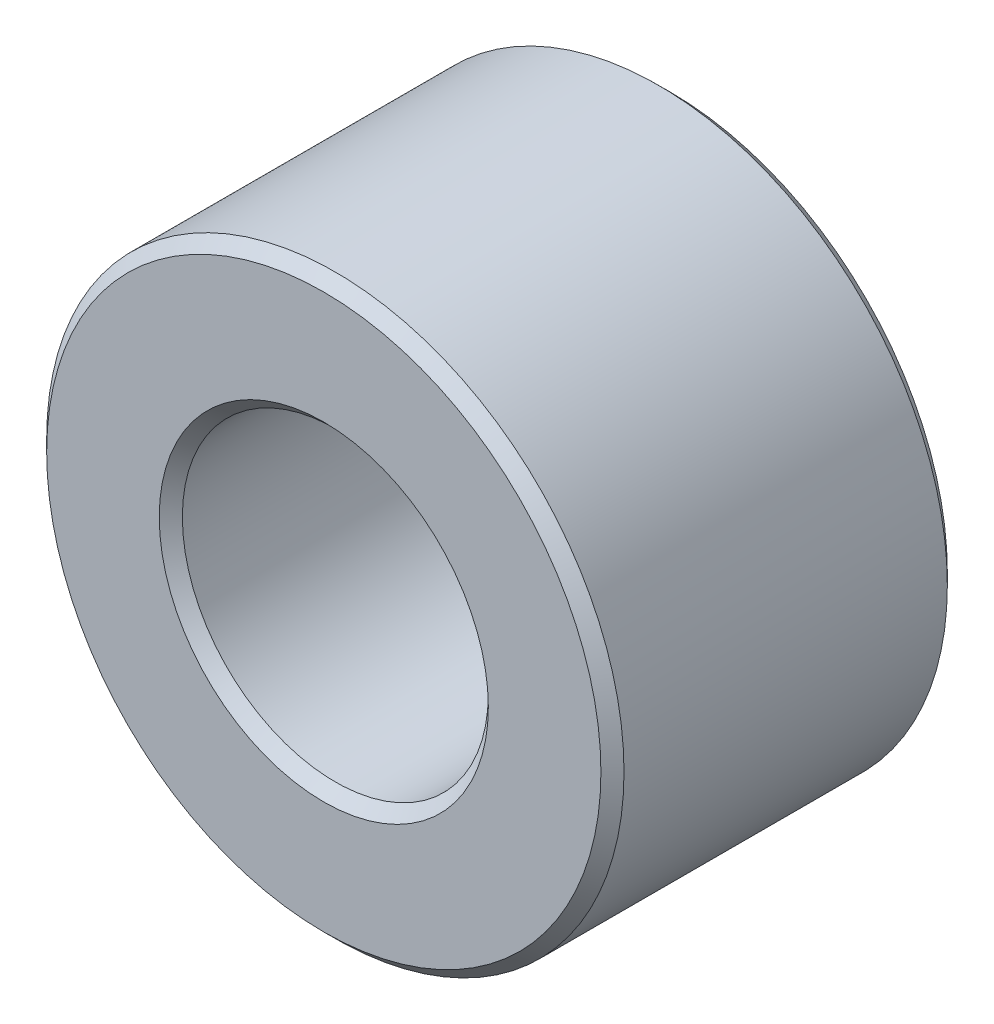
ISO-10303-21;
HEADER;
FILE_DESCRIPTION(('STEP AP214'),'2;1');
FILE_NAME('part.step','',(''),(''),'','','');
FILE_SCHEMA(('AUTOMOTIVE_DESIGN { 1 0 10303 214 1 1 1 1 }'));
ENDSEC;
DATA;
#1=APPLICATION_CONTEXT('core data for automotive mechanical design processes');
#2=APPLICATION_PROTOCOL_DEFINITION('international standard','automotive_design',2000,#1);
#3=PRODUCT_CONTEXT('',#1,'mechanical');
#4=PRODUCT('Part','Part','',(#3));
#5=PRODUCT_RELATED_PRODUCT_CATEGORY('part','',(#4));
#6=PRODUCT_DEFINITION_FORMATION('','',#4);
#7=PRODUCT_DEFINITION_CONTEXT('part definition',#1,'design');
#8=PRODUCT_DEFINITION('design','',#6,#7);
#9=PRODUCT_DEFINITION_SHAPE('','',#8);
#10=(LENGTH_UNIT() NAMED_UNIT(*) SI_UNIT(.MILLI.,.METRE.));
#11=(NAMED_UNIT(*) PLANE_ANGLE_UNIT() SI_UNIT($,.RADIAN.));
#12=(NAMED_UNIT(*) SI_UNIT($,.STERADIAN.) SOLID_ANGLE_UNIT());
#13=UNCERTAINTY_MEASURE_WITH_UNIT(LENGTH_MEASURE(1.E-05),#10,'distance_accuracy_value','');
#14=(GEOMETRIC_REPRESENTATION_CONTEXT(3) GLOBAL_UNCERTAINTY_ASSIGNED_CONTEXT((#13)) GLOBAL_UNIT_ASSIGNED_CONTEXT((#10,
#11,#12)) REPRESENTATION_CONTEXT('',''));
#15=CARTESIAN_POINT('',(0.,0.,0.));
#16=DIRECTION('',(0.,0.,1.));
#17=DIRECTION('',(1.,0.,0.));
#18=AXIS2_PLACEMENT_3D('',#15,#16,#17);
#19=CARTESIAN_POINT('',(0.,0.,3.));
#20=DIRECTION('',(0.,0.,1.));
#21=DIRECTION('',(1.,0.,0.));
#22=AXIS2_PLACEMENT_3D('',#19,#20,#21);
#23=PLANE('',#22);
#24=CARTESIAN_POINT('',(0.,0.,3.));
#25=DIRECTION('',(0.,0.,1.));
#26=DIRECTION('',(1.,0.,0.));
#27=AXIS2_PLACEMENT_3D('',#24,#25,#26);
#28=CIRCLE('',#27,2.85);
#29=CARTESIAN_POINT('',(2.85,0.,3.));
#30=VERTEX_POINT('',#29);
#31=EDGE_CURVE('E10',#30,#30,#28,.F.);
#32=ORIENTED_EDGE('',*,*,#31,.T.);
#33=EDGE_LOOP('',(#32));
#34=FACE_BOUND('',#33,.T.);
#35=CARTESIAN_POINT('',(0.,0.,3.));
#36=DIRECTION('',(0.,0.,1.));
#37=DIRECTION('',(1.,0.,0.));
#38=AXIS2_PLACEMENT_3D('',#35,#36,#37);
#39=CIRCLE('',#38,4.8);
#40=CARTESIAN_POINT('',(4.8,0.,3.));
#41=VERTEX_POINT('',#40);
#42=EDGE_CURVE('E45',#41,#41,#39,.T.);
#43=ORIENTED_EDGE('',*,*,#42,.T.);
#44=EDGE_LOOP('',(#43));
#45=FACE_BOUND('',#44,.T.);
#46=ADVANCED_FACE('F37',(#34,#45),#23,.T.);
#47=CARTESIAN_POINT('',(0.,0.,-3.));
#48=DIRECTION('',(0.,0.,1.));
#49=DIRECTION('',(1.,0.,0.));
#50=AXIS2_PLACEMENT_3D('',#47,#48,#49);
#51=PLANE('',#50);
#52=CARTESIAN_POINT('',(0.,0.,-3.));
#53=DIRECTION('',(0.,0.,1.));
#54=DIRECTION('',(1.,0.,0.));
#55=AXIS2_PLACEMENT_3D('',#52,#53,#54);
#56=CIRCLE('',#55,4.8);
#57=CARTESIAN_POINT('',(4.8,0.,-3.));
#58=VERTEX_POINT('',#57);
#59=EDGE_CURVE('E64',#58,#58,#56,.F.);
#60=ORIENTED_EDGE('',*,*,#59,.T.);
#61=EDGE_LOOP('',(#60));
#62=FACE_BOUND('',#61,.T.);
#63=CARTESIAN_POINT('',(0.,0.,-3.));
#64=DIRECTION('',(0.,0.,1.));
#65=DIRECTION('',(1.,0.,0.));
#66=AXIS2_PLACEMENT_3D('',#63,#64,#65);
#67=CIRCLE('',#66,2.85);
#68=CARTESIAN_POINT('',(-2.85,0.,-3.));
#69=VERTEX_POINT('',#68);
#70=EDGE_CURVE('E67',#69,#69,#67,.T.);
#71=ORIENTED_EDGE('',*,*,#70,.T.);
#72=EDGE_LOOP('',(#71));
#73=FACE_BOUND('',#72,.T.);
#74=ADVANCED_FACE('F89',(#62,#73),#51,.F.);
#75=CARTESIAN_POINT('',(0.,0.,3.));
#76=DIRECTION('',(0.,0.,-1.));
#77=DIRECTION('',(-1.,0.,0.));
#78=AXIS2_PLACEMENT_3D('',#75,#76,#77);
#79=CYLINDRICAL_SURFACE('',#78,5.);
#80=CARTESIAN_POINT('',(0.,0.,-2.8));
#81=DIRECTION('',(0.,0.,1.));
#82=DIRECTION('',(1.,0.,0.));
#83=AXIS2_PLACEMENT_3D('',#80,#81,#82);
#84=CIRCLE('',#83,5.);
#85=CARTESIAN_POINT('',(5.,0.,-2.8));
#86=VERTEX_POINT('',#85);
#87=EDGE_CURVE('E71',#86,#86,#84,.T.);
#88=ORIENTED_EDGE('',*,*,#87,.T.);
#89=EDGE_LOOP('',(#88));
#90=FACE_BOUND('',#89,.T.);
#91=CARTESIAN_POINT('',(0.,0.,2.8));
#92=DIRECTION('',(0.,0.,1.));
#93=DIRECTION('',(1.,0.,0.));
#94=AXIS2_PLACEMENT_3D('',#91,#92,#93);
#95=CIRCLE('',#94,5.);
#96=CARTESIAN_POINT('',(5.,0.,2.8));
#97=VERTEX_POINT('',#96);
#98=EDGE_CURVE('E74',#97,#97,#95,.F.);
#99=ORIENTED_EDGE('',*,*,#98,.T.);
#100=EDGE_LOOP('',(#99));
#101=FACE_BOUND('',#100,.T.);
#102=ADVANCED_FACE('F78',(#90,#101),#79,.T.);
#103=CARTESIAN_POINT('',(0.,0.,3.));
#104=DIRECTION('',(0.,0.,-1.));
#105=DIRECTION('',(-1.,0.,0.));
#106=AXIS2_PLACEMENT_3D('',#103,#104,#105);
#107=CYLINDRICAL_SURFACE('',#106,2.65);
#108=CARTESIAN_POINT('',(0.,0.,-2.8));
#109=DIRECTION('',(0.,0.,1.));
#110=DIRECTION('',(1.,0.,0.));
#111=AXIS2_PLACEMENT_3D('',#108,#109,#110);
#112=CIRCLE('',#111,2.65);
#113=CARTESIAN_POINT('',(-2.65,0.,-2.8));
#114=VERTEX_POINT('',#113);
#115=EDGE_CURVE('E52',#114,#114,#112,.F.);
#116=ORIENTED_EDGE('',*,*,#115,.T.);
#117=EDGE_LOOP('',(#116));
#118=FACE_BOUND('',#117,.T.);
#119=CARTESIAN_POINT('',(0.,0.,2.8));
#120=DIRECTION('',(0.,0.,1.));
#121=DIRECTION('',(1.,0.,0.));
#122=AXIS2_PLACEMENT_3D('',#119,#120,#121);
#123=CIRCLE('',#122,2.65);
#124=CARTESIAN_POINT('',(2.65,0.,2.8));
#125=VERTEX_POINT('',#124);
#126=EDGE_CURVE('E58',#125,#125,#123,.T.);
#127=ORIENTED_EDGE('',*,*,#126,.T.);
#128=EDGE_LOOP('',(#127));
#129=FACE_BOUND('',#128,.T.);
#130=ADVANCED_FACE('F97',(#118,#129),#107,.F.);
#131=CARTESIAN_POINT('',(0.,0.,-2.8));
#132=DIRECTION('',(0.,0.,1.));
#133=DIRECTION('',(1.,0.,0.));
#134=AXIS2_PLACEMENT_3D('',#131,#132,#133);
#135=CONICAL_SURFACE('',#134,5.,0.785398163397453);
#136=ORIENTED_EDGE('',*,*,#59,.F.);
#137=EDGE_LOOP('',(#136));
#138=FACE_BOUND('',#137,.T.);
#139=ORIENTED_EDGE('',*,*,#87,.F.);
#140=EDGE_LOOP('',(#139));
#141=FACE_BOUND('',#140,.T.);
#142=ADVANCED_FACE('F102',(#138,#141),#135,.T.);
#143=CARTESIAN_POINT('',(0.,0.,-3.));
#144=DIRECTION('',(0.,0.,-1.));
#145=DIRECTION('',(-1.,0.,0.));
#146=AXIS2_PLACEMENT_3D('',#143,#144,#145);
#147=CONICAL_SURFACE('',#146,2.85,0.785398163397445);
#148=CARTESIAN_POINT('',(-2.65,0.,-2.8));
#149=CARTESIAN_POINT('',(-2.65208333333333,0.,-2.80208333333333));
#150=CARTESIAN_POINT('',(-2.65416666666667,0.,-2.80416666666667));
#151=CARTESIAN_POINT('',(-2.65833333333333,0.,-2.80833333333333));
#152=CARTESIAN_POINT('',(-2.66041666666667,0.,-2.81041666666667));
#153=CARTESIAN_POINT('',(-2.66458333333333,0.,-2.81458333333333));
#154=CARTESIAN_POINT('',(-2.66666666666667,0.,-2.81666666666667));
#155=CARTESIAN_POINT('',(-2.67083333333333,0.,-2.82083333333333));
#156=CARTESIAN_POINT('',(-2.67291666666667,0.,-2.82291666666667));
#157=CARTESIAN_POINT('',(-2.67708333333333,0.,-2.82708333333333));
#158=CARTESIAN_POINT('',(-2.67916666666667,0.,-2.82916666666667));
#159=CARTESIAN_POINT('',(-2.68333333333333,0.,-2.83333333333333));
#160=CARTESIAN_POINT('',(-2.68541666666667,0.,-2.83541666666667));
#161=CARTESIAN_POINT('',(-2.68958333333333,0.,-2.83958333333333));
#162=CARTESIAN_POINT('',(-2.69166666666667,0.,-2.84166666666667));
#163=CARTESIAN_POINT('',(-2.69583333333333,0.,-2.84583333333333));
#164=CARTESIAN_POINT('',(-2.69791666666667,0.,-2.84791666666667));
#165=CARTESIAN_POINT('',(-2.70208333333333,0.,-2.85208333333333));
#166=CARTESIAN_POINT('',(-2.70416666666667,0.,-2.85416666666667));
#167=CARTESIAN_POINT('',(-2.70833333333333,0.,-2.85833333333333));
#168=CARTESIAN_POINT('',(-2.71041666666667,0.,-2.86041666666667));
#169=CARTESIAN_POINT('',(-2.71458333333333,0.,-2.86458333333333));
#170=CARTESIAN_POINT('',(-2.71666666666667,0.,-2.86666666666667));
#171=CARTESIAN_POINT('',(-2.72083333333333,0.,-2.87083333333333));
#172=CARTESIAN_POINT('',(-2.72291666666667,0.,-2.87291666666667));
#173=CARTESIAN_POINT('',(-2.72708333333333,0.,-2.87708333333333));
#174=CARTESIAN_POINT('',(-2.72916666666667,0.,-2.87916666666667));
#175=CARTESIAN_POINT('',(-2.73333333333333,0.,-2.88333333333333));
#176=CARTESIAN_POINT('',(-2.73541666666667,0.,-2.88541666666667));
#177=CARTESIAN_POINT('',(-2.73958333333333,0.,-2.88958333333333));
#178=CARTESIAN_POINT('',(-2.74166666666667,0.,-2.89166666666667));
#179=CARTESIAN_POINT('',(-2.74583333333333,0.,-2.89583333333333));
#180=CARTESIAN_POINT('',(-2.74791666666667,0.,-2.89791666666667));
#181=CARTESIAN_POINT('',(-2.75208333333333,0.,-2.90208333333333));
#182=CARTESIAN_POINT('',(-2.75416666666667,0.,-2.90416666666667));
#183=CARTESIAN_POINT('',(-2.75833333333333,0.,-2.90833333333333));
#184=CARTESIAN_POINT('',(-2.76041666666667,0.,-2.91041666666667));
#185=CARTESIAN_POINT('',(-2.76458333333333,0.,-2.91458333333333));
#186=CARTESIAN_POINT('',(-2.76666666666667,0.,-2.91666666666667));
#187=CARTESIAN_POINT('',(-2.77083333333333,0.,-2.92083333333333));
#188=CARTESIAN_POINT('',(-2.77291666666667,0.,-2.92291666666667));
#189=CARTESIAN_POINT('',(-2.77708333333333,0.,-2.92708333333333));
#190=CARTESIAN_POINT('',(-2.77916666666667,0.,-2.92916666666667));
#191=CARTESIAN_POINT('',(-2.78333333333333,0.,-2.93333333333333));
#192=CARTESIAN_POINT('',(-2.78541666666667,0.,-2.93541666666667));
#193=CARTESIAN_POINT('',(-2.78958333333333,0.,-2.93958333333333));
#194=CARTESIAN_POINT('',(-2.79166666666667,0.,-2.94166666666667));
#195=CARTESIAN_POINT('',(-2.79583333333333,0.,-2.94583333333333));
#196=CARTESIAN_POINT('',(-2.79791666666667,0.,-2.94791666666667));
#197=CARTESIAN_POINT('',(-2.80208333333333,0.,-2.95208333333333));
#198=CARTESIAN_POINT('',(-2.80416666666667,0.,-2.95416666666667));
#199=CARTESIAN_POINT('',(-2.80833333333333,0.,-2.95833333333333));
#200=CARTESIAN_POINT('',(-2.81041666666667,0.,-2.96041666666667));
#201=CARTESIAN_POINT('',(-2.81458333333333,0.,-2.96458333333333));
#202=CARTESIAN_POINT('',(-2.81666666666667,0.,-2.96666666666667));
#203=CARTESIAN_POINT('',(-2.82083333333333,0.,-2.97083333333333));
#204=CARTESIAN_POINT('',(-2.82291666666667,0.,-2.97291666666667));
#205=CARTESIAN_POINT('',(-2.82708333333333,0.,-2.97708333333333));
#206=CARTESIAN_POINT('',(-2.82916666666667,0.,-2.97916666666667));
#207=CARTESIAN_POINT('',(-2.83333333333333,0.,-2.98333333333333));
#208=CARTESIAN_POINT('',(-2.83541666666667,0.,-2.98541666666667));
#209=CARTESIAN_POINT('',(-2.83958333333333,0.,-2.98958333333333));
#210=CARTESIAN_POINT('',(-2.84166666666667,0.,-2.99166666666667));
#211=CARTESIAN_POINT('',(-2.84583333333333,0.,-2.99583333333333));
#212=CARTESIAN_POINT('',(-2.84791666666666,0.,-2.99791666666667));
#213=CARTESIAN_POINT('',(-2.85,0.,-3.));
#214=B_SPLINE_CURVE_WITH_KNOTS('',3,(#148,#149,#150,#151,#152,#153,#154,#155,#156,#157,#158,
#159,#160,#161,#162,#163,#164,#165,#166,#167,#168,#169,#170,#171,#172,#173,#174,#175,#176,#177,
#178,#179,#180,#181,#182,#183,#184,#185,#186,#187,#188,#189,#190,#191,#192,#193,#194,#195,#196,
#197,#198,#199,#200,#201,#202,#203,#204,#205,#206,#207,#208,#209,#210,#211,#212,#213),
.UNSPECIFIED.,.F.,.F.,(4,2,2,2,2,2,2,2,2,2,2,2,2,2,2,2,2,2,2,2,2,2,2,2,2,2,2,2,2,2,2,2,4),(0.,
0.00883883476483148,0.0176776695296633,0.0265165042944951,0.0353553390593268,0.0441941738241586,
0.0530330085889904,0.0618718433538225,0.070710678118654,0.0795495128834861,0.0883883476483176,
0.0972271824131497,0.106066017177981,0.114904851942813,0.123743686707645,0.132582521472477,
0.141421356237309,0.15026019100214,0.159099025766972,0.167937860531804,0.176776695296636,
0.185615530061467,0.194454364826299,0.203293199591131,0.212132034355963,0.220970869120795,
0.229809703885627,0.238648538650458,0.24748737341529,0.256326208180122,0.265165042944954,
0.274003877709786,0.282842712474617),.UNSPECIFIED.);
#215=EDGE_CURVE('BSEAM86',#114,#69,#214,.T.);
#216=ORIENTED_EDGE('',*,*,#115,.F.);
#217=ORIENTED_EDGE('',*,*,#70,.F.);
#218=ORIENTED_EDGE('',*,*,#215,.T.);
#219=ORIENTED_EDGE('',*,*,#215,.F.);
#220=EDGE_LOOP('',(#216,#218,#217,#219));
#221=FACE_BOUND('',#220,.T.);
#222=ADVANCED_FACE('F86',(#221),#147,.F.);
#223=CARTESIAN_POINT('',(0.,0.,2.8));
#224=DIRECTION('',(0.,0.,1.));
#225=DIRECTION('',(1.,0.,0.));
#226=AXIS2_PLACEMENT_3D('',#223,#224,#225);
#227=CONICAL_SURFACE('',#226,2.65,0.785398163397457);
#228=ORIENTED_EDGE('',*,*,#31,.F.);
#229=EDGE_LOOP('',(#228));
#230=FACE_BOUND('',#229,.T.);
#231=ORIENTED_EDGE('',*,*,#126,.F.);
#232=EDGE_LOOP('',(#231));
#233=FACE_BOUND('',#232,.T.);
#234=ADVANCED_FACE('F82',(#230,#233),#227,.F.);
#235=CARTESIAN_POINT('',(0.,0.,3.));
#236=DIRECTION('',(0.,0.,-1.));
#237=DIRECTION('',(-1.,0.,0.));
#238=AXIS2_PLACEMENT_3D('',#235,#236,#237);
#239=CONICAL_SURFACE('',#238,4.8,0.78539816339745);
#240=ORIENTED_EDGE('',*,*,#98,.F.);
#241=EDGE_LOOP('',(#240));
#242=FACE_BOUND('',#241,.T.);
#243=ORIENTED_EDGE('',*,*,#42,.F.);
#244=EDGE_LOOP('',(#243));
#245=FACE_BOUND('',#244,.T.);
#246=ADVANCED_FACE('F39',(#242,#245),#239,.T.);
#247=CLOSED_SHELL('',(#46,#74,#102,#130,#142,#222,#234,#246));
#248=MANIFOLD_SOLID_BREP('B2',#247);
#249=ADVANCED_BREP_SHAPE_REPRESENTATION('',(#18,#248),#14);
#250=SHAPE_DEFINITION_REPRESENTATION(#9,#249);
ENDSEC;
END-ISO-10303-21;
